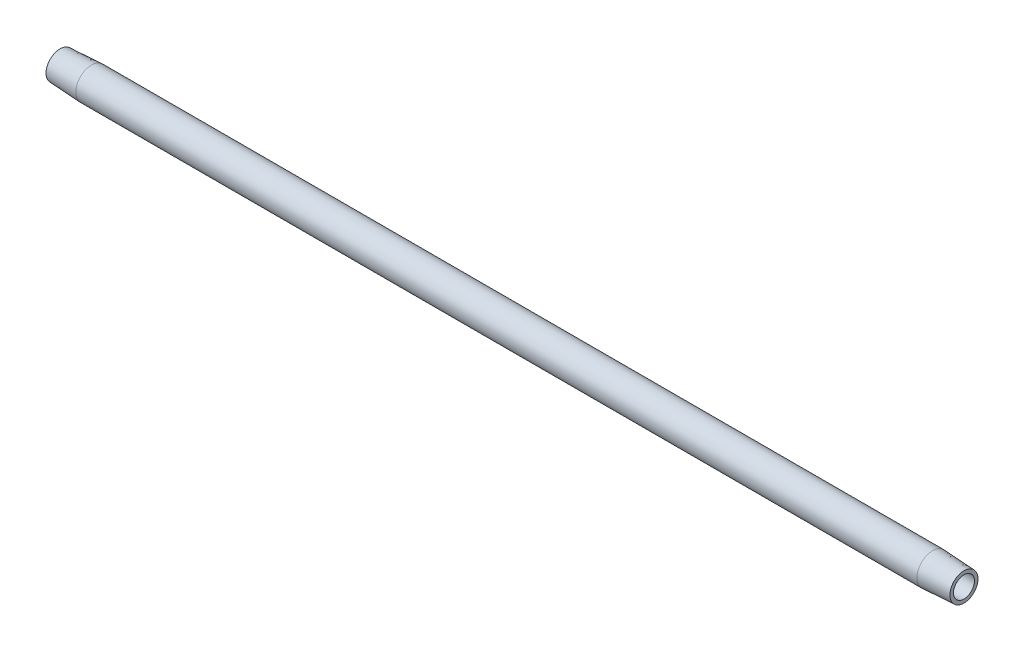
from build123d import *


with BuildPart() as part:
    # Sketch2 → Revolve1 (revolve)
    with BuildSketch(Plane.XY, mode=Mode.PRIVATE) as revolve1_sk:
        Polygon((7.9375, 3.96875), (0, 3.552763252), (0, 2.6543), (228.6, 2.6543), (228.6, 3.552763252), (220.6625, 3.96875), align=None)
    revolve(revolve1_sk.sketch.rotate(Axis((0.476141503, 0, 0), (1, 0, 0)), 90), axis=Axis((0.476141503, 0, 0), (1, 0, 0)))


solid = part.part
